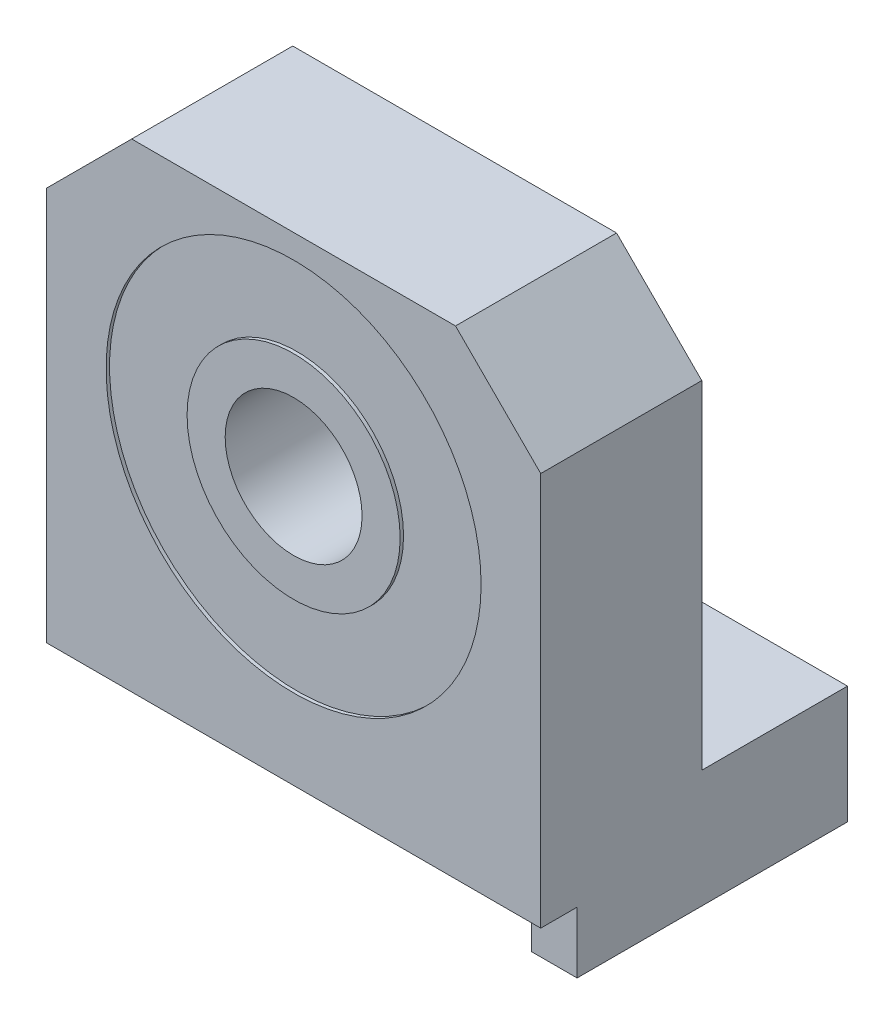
from build123d import *

# Parameters (mm, degrees)
SKETCH1_W               = 36.83
SKETCH1_H               = 39.878
EXTRUDE1_DEPTH          = 12
SKETCH7_R               = 2.4257
CUT_EXTRUDE1_DEPTH      = 32.439110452
SKETCH8_R               = 10.795
EXTRUDE3_DEPTH          = 13.524
SKETCH12_R              = 4.3688
CUT_EXTRUDE3_DEPTH      = 33.051774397
SKETCH13_W              = 36.83
SKETCH13_H              = 6.731
EXTRUDE4_DEPTH          = 22.86
SKETCH15_W              = 3.415000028
SKETCH15_H              = 22.86
EXTRUDE5_DEPTH          = 2.032
SKETCH18_R              = 1.5494
CUT_EXTRUDE7_DEPTH      = 48.733205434
SKETCH23_W              = 36.83
SKETCH23_H              = 12
CUT_EXTRUDE10_DEPTH     = 1.651
CHAMFER2_SIZE           = 6.35
SKETCH19_W              = 22.86
SKETCH19_H              = 2.032
CUT_EXTRUDE8_DEPTH      = 44.591856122
M12X1_00_SPECIAL_D      = 10.2
CUT_EXTRUDE9_DEPTH      = 34.508206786
CUT_EXTRUDE9_DEPTH_BACK = 34.508206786
SKETCH22_W              = 2.71018
SKETCH22_H              = 4.572
SKETCH24_OUTSIDE_W      = 50.782
SKETCH24_OUTSIDE_H      = 54.211
SKETCH24_OUTSIDE_R      = 7.9375
EXTRUDE8_DEPTH          = 1.524
EXTRUDE9_START          = -12
SKETCH25_R              = 2.4257
EXTRUDE9_DEPTH          = 12
SKETCH26_R              = 13.97
SKETCH26_R_2            = 5.1
CUT_EXTRUDE11_DEPTH     = 1.778
BOSS_EXTRUDE1_START     = 0.254
SKETCH27_R              = 7.9375
SKETCH27_R_2            = 5.1
BOSS_EXTRUDE1_DEPTH     = 0.254


with BuildPart() as part:
    # Sketch1 → Extrude1 (new body)
    with BuildSketch(Plane.XY):
        with Locations((0, -2.54)):
            Rectangle(SKETCH1_W, SKETCH1_H)
    extrude(amount=EXTRUDE1_DEPTH)

    # Sketch7 → Cut-Extrude1 (cut, through all)
    with BuildSketch(Plane(origin=(0, 0, 0), x_dir=(-1, 0, 0), z_dir=(0, 0, -1))):
        with Locations((14.605, 6.858)):
            Circle(SKETCH7_R)
    extrude(amount=-CUT_EXTRUDE1_DEPTH, mode=Mode.SUBTRACT)

    # Sketch8 → Extrude3 (add)
    with BuildSketch(Plane(origin=(0, 0, 0), x_dir=(-1, 0, 0), z_dir=(0, 0, -1))):
        with Locations(Location((-1.9685, -3.064398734, 0), (0, 0, 180))):
            Circle(SKETCH8_R)
    extrude(amount=-EXTRUDE3_DEPTH)

    # Sketch12 → Cut-Extrude3 (cut, through all)
    with BuildSketch(Plane.XY.offset(13.524)):
        Circle(SKETCH12_R)
    extrude(amount=-CUT_EXTRUDE3_DEPTH, mode=Mode.SUBTRACT)

    # Sketch13 → Extrude4 (add)
    with BuildSketch(Plane.XY.offset(12)):
        with Locations((0, -19.1135)):
            Rectangle(SKETCH13_W, SKETCH13_H)
    extrude(amount=-EXTRUDE4_DEPTH)

    # Sketch15 → Extrude5 (add)
    with BuildSketch(Plane.XZ.offset(22.479)):
        with Locations((16.707499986, 0.57)):
            Rectangle(SKETCH15_W, SKETCH15_H)
        with Locations((-16.707499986, 0.57)):
            Rectangle(SKETCH15_W, SKETCH15_H)
    extrude(amount=EXTRUDE5_DEPTH)

    # Sketch18 → Cut-Extrude7 (cut, through all)
    with BuildSketch(Plane.XZ.offset(24.511)):
        with Locations(Location((-10.500000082, -3.960000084, 0), (0, 0, 180))):
            Circle(SKETCH18_R)
    cut_extrude7 = extrude(amount=-CUT_EXTRUDE7_DEPTH, mode=Mode.SUBTRACT)

    # Mirror2: Cut-Extrude7 across plane
    add(cut_extrude7.mirror(Plane(origin=(0, 0, 0), x_dir=(0, 0, 1), z_dir=(1, 0, 0))), mode=Mode.SUBTRACT)

    # Sketch23 → Cut-Extrude10 (cut)
    with BuildSketch(Plane(origin=(0, 17.399, 0), x_dir=(-1, 0, 0), z_dir=(0, 1, 0))):
        with Locations((0, 6)):
            Rectangle(SKETCH23_W, SKETCH23_H)
    extrude(amount=-CUT_EXTRUDE10_DEPTH, mode=Mode.SUBTRACT)

    # Chamfer2
    chamfer2_edges = [part.edges().sort_by_distance(p)[0] for p in [
        (18.415, 15.748, 6),
        (-18.415, 15.748, 6),
    ]]
    chamfer(chamfer2_edges, length=CHAMFER2_SIZE)

    # Sketch19 → Cut-Extrude8 (cut, through all)
    with BuildSketch(Plane(origin=(-14.999999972, 0, 0), x_dir=(0, 0, -1), z_dir=(1, 0, 0))):
        with Locations((-0.57, -23.495)):
            Rectangle(SKETCH19_W, SKETCH19_H)
    extrude(amount=-CUT_EXTRUDE8_DEPTH, mode=Mode.SUBTRACT)

    # M12x1.00 SPECIAL (through all)
    with Locations(Plane(origin=(0, 0, 0), x_dir=(-1, 0, 0), z_dir=(0, 0, -1))):
        with Locations((0, 0)):
            Hole(M12X1_00_SPECIAL_D / 2)

    # Sketch22 → Cut-Extrude9 (cut, two sides: drawn at the far end of the back side and taken through both)
    with BuildSketch(Plane(origin=(0, 0, 0), x_dir=(0, 0, -1), z_dir=(1, 0, 0)).offset(-CUT_EXTRUDE9_DEPTH_BACK)):
        with Locations((-10.64491, -22.225)):
            Rectangle(SKETCH22_W, SKETCH22_H)
    extrude(amount=CUT_EXTRUDE9_DEPTH + CUT_EXTRUDE9_DEPTH_BACK, mode=Mode.SUBTRACT)

    # Sketch24 outside → Extrude8 (cut)
    with BuildSketch(Plane.XY.offset(13.524)):
        with Locations((0, -4.3815)):
            Rectangle(SKETCH24_OUTSIDE_W, SKETCH24_OUTSIDE_H)
        Circle(SKETCH24_OUTSIDE_R, mode=Mode.SUBTRACT)
    extrude(amount=-EXTRUDE8_DEPTH, mode=Mode.SUBTRACT)

    # Sketch25 → Extrude9 (add)
    with BuildSketch(Plane.XY.offset(12).offset(EXTRUDE9_START)):
        with Locations((-14.605, 6.858)):
            Circle(SKETCH25_R)
    extrude(amount=EXTRUDE9_DEPTH)

    # Sketch26 → Cut-Extrude11 (cut)
    with BuildSketch(Plane.XY.offset(13.524)):
        Circle(SKETCH26_R)
        with Locations(Location((0, 0, 0), (0, 0, 180))):
            Circle(SKETCH26_R_2, mode=Mode.SUBTRACT)
    extrude(amount=-CUT_EXTRUDE11_DEPTH, mode=Mode.SUBTRACT)

    # Sketch27 → Boss-Extrude1 (add)
    with BuildSketch(Plane.XY.offset(11.746).offset(BOSS_EXTRUDE1_START)):
        Circle(SKETCH27_R)
        with Locations(Location((0, 0, 0), (0, 0, 180))):
            Circle(SKETCH27_R_2, mode=Mode.SUBTRACT)
    extrude(amount=-BOSS_EXTRUDE1_DEPTH)


solid = part.part
